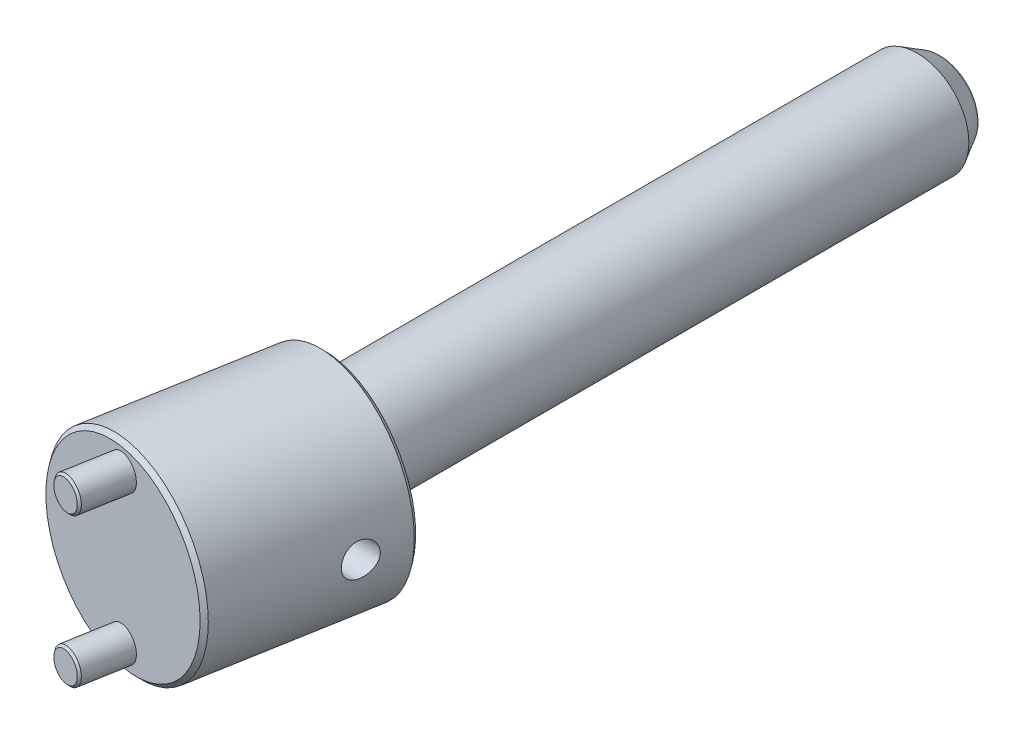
ISO-10303-21;
HEADER;
FILE_DESCRIPTION(('STEP AP214'),'2;1');
FILE_NAME('part.step','',(''),(''),'','','');
FILE_SCHEMA(('AUTOMOTIVE_DESIGN { 1 0 10303 214 1 1 1 1 }'));
ENDSEC;
DATA;
#1=APPLICATION_CONTEXT('core data for automotive mechanical design processes');
#2=APPLICATION_PROTOCOL_DEFINITION('international standard','automotive_design',2000,#1);
#3=PRODUCT_CONTEXT('',#1,'mechanical');
#4=PRODUCT('Part','Part','',(#3));
#5=PRODUCT_RELATED_PRODUCT_CATEGORY('part','',(#4));
#6=PRODUCT_DEFINITION_FORMATION('','',#4);
#7=PRODUCT_DEFINITION_CONTEXT('part definition',#1,'design');
#8=PRODUCT_DEFINITION('design','',#6,#7);
#9=PRODUCT_DEFINITION_SHAPE('','',#8);
#10=(LENGTH_UNIT() NAMED_UNIT(*) SI_UNIT(.MILLI.,.METRE.));
#11=(NAMED_UNIT(*) PLANE_ANGLE_UNIT() SI_UNIT($,.RADIAN.));
#12=(NAMED_UNIT(*) SI_UNIT($,.STERADIAN.) SOLID_ANGLE_UNIT());
#13=UNCERTAINTY_MEASURE_WITH_UNIT(LENGTH_MEASURE(1.E-05),#10,'distance_accuracy_value','');
#14=(GEOMETRIC_REPRESENTATION_CONTEXT(3) GLOBAL_UNCERTAINTY_ASSIGNED_CONTEXT((#13)) GLOBAL_UNIT_ASSIGNED_CONTEXT((#10,
#11,#12)) REPRESENTATION_CONTEXT('',''));
#15=CARTESIAN_POINT('',(0.,0.,0.));
#16=DIRECTION('',(0.,0.,1.));
#17=DIRECTION('',(1.,0.,0.));
#18=AXIS2_PLACEMENT_3D('',#15,#16,#17);
#19=CARTESIAN_POINT('',(0.,0.,-150.));
#20=DIRECTION('',(0.,0.,-1.));
#21=DIRECTION('',(0.,1.,0.));
#22=AXIS2_PLACEMENT_3D('',#19,#20,#21);
#23=PLANE('',#22);
#24=CARTESIAN_POINT('',(0.,0.,-150.));
#25=DIRECTION('',(0.,0.,1.));
#26=DIRECTION('',(-1.,0.,0.));
#27=AXIS2_PLACEMENT_3D('',#24,#25,#26);
#28=CIRCLE('',#27,7.881197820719);
#29=CARTESIAN_POINT('',(-7.8811978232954,0.,-150.));
#30=VERTEX_POINT('',#29);
#31=CARTESIAN_POINT('',(7.8811978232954,0.,-150.));
#32=VERTEX_POINT('',#31);
#33=EDGE_CURVE('P0_E38',#30,#32,#28,.T.);
#34=ORIENTED_EDGE('',*,*,#33,.F.);
#35=CARTESIAN_POINT('',(0.,0.,-150.));
#36=DIRECTION('',(0.,0.,1.));
#37=DIRECTION('',(1.,0.,0.));
#38=AXIS2_PLACEMENT_3D('',#35,#36,#37);
#39=CIRCLE('',#38,7.881197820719);
#40=EDGE_CURVE('P0_E42',#32,#30,#39,.T.);
#41=ORIENTED_EDGE('',*,*,#40,.F.);
#42=EDGE_LOOP('',(#34,#41));
#43=FACE_BOUND('',#42,.T.);
#44=ADVANCED_FACE('P0_F17',(#43),#23,.T.);
#45=CARTESIAN_POINT('',(0.,0.,-148.));
#46=DIRECTION('',(0.,0.,-1.));
#47=DIRECTION('',(0.999976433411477,-0.00686532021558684,0.));
#48=AXIS2_PLACEMENT_3D('',#45,#46,#47);
#49=TOROIDAL_SURFACE('',#48,7.881197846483,2.);
#50=ORIENTED_EDGE('',*,*,#33,.T.);
#51=ORIENTED_EDGE('',*,*,#40,.T.);
#52=EDGE_LOOP('',(#50,#51));
#53=FACE_BOUND('',#52,.T.);
#54=CARTESIAN_POINT('',(0.,0.,-149.000000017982));
#55=DIRECTION('',(0.,0.,1.));
#56=DIRECTION('',(1.,0.,0.));
#57=AXIS2_PLACEMENT_3D('',#54,#55,#56);
#58=CIRCLE('',#57,9.61324864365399);
#59=CARTESIAN_POINT('',(9.61324864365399,0.,-149.000000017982));
#60=VERTEX_POINT('',#59);
#61=EDGE_CURVE('P0_E48',#60,#60,#58,.T.);
#62=ORIENTED_EDGE('',*,*,#61,.F.);
#63=EDGE_LOOP('',(#62));
#64=FACE_BOUND('',#63,.T.);
#65=ADVANCED_FACE('P0_F40',(#53,#64),#49,.T.);
#66=CARTESIAN_POINT('',(0.,0.,37.5));
#67=DIRECTION('',(0.,0.,-1.));
#68=DIRECTION('',(0.,1.,0.));
#69=AXIS2_PLACEMENT_3D('',#66,#67,#68);
#70=PLANE('',#69);
#71=CARTESIAN_POINT('',(0.,0.,37.4999998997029));
#72=DIRECTION('',(0.,0.,-1.));
#73=DIRECTION('',(0.,1.,0.));
#74=AXIS2_PLACEMENT_3D('',#71,#72,#73);
#75=CIRCLE('',#74,11.4999995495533);
#76=CARTESIAN_POINT('',(0.,11.4999995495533,37.4999998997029));
#77=VERTEX_POINT('',#76);
#78=EDGE_CURVE('P0_E85',#77,#77,#75,.T.);
#79=ORIENTED_EDGE('',*,*,#78,.F.);
#80=EDGE_LOOP('',(#79));
#81=FACE_BOUND('',#80,.T.);
#82=ADVANCED_FACE('P0_F76',(#81),#70,.F.);
#83=CARTESIAN_POINT('',(4.30940107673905,0.,17.));
#84=DIRECTION('',(1.,0.,0.));
#85=DIRECTION('',(0.,0.,1.));
#86=AXIS2_PLACEMENT_3D('',#83,#84,#85);
#87=CONICAL_SURFACE('',#86,3.9999999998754,1.04719755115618);
#88=CARTESIAN_POINT('',(1.99999999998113,0.,16.9999999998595));
#89=VERTEX_POINT('',#88);
#90=VERTEX_LOOP('',#89);
#91=FACE_BOUND('',#90,.T.);
#92=CARTESIAN_POINT('',(4.309401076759,0.,17.));
#93=DIRECTION('',(1.,0.,0.));
#94=DIRECTION('',(0.,0.,1.));
#95=AXIS2_PLACEMENT_3D('',#92,#93,#94);
#96=CIRCLE('',#95,4.);
#97=CARTESIAN_POINT('',(4.309401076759,0.,21.));
#98=VERTEX_POINT('',#97);
#99=EDGE_CURVE('P0_E82',#98,#98,#96,.T.);
#100=ORIENTED_EDGE('',*,*,#99,.T.);
#101=EDGE_LOOP('',(#100));
#102=FACE_BOUND('',#101,.T.);
#103=ADVANCED_FACE('P0_F116',(#91,#102),#87,.F.);
#104=CARTESIAN_POINT('',(0.,0.,-143.999999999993));
#105=DIRECTION('',(0.,0.,1.));
#106=DIRECTION('',(0.,-1.,0.));
#107=AXIS2_PLACEMENT_3D('',#104,#105,#106);
#108=CONICAL_SURFACE('',#107,12.4999999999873,0.5235987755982);
#109=CARTESIAN_POINT('',(0.,0.,-144.));
#110=DIRECTION('',(0.,0.,-1.));
#111=DIRECTION('',(0.,1.,0.));
#112=AXIS2_PLACEMENT_3D('',#109,#110,#111);
#113=CIRCLE('',#112,12.5);
#114=CARTESIAN_POINT('',(0.,12.5,-144.));
#115=VERTEX_POINT('',#114);
#116=EDGE_CURVE('P0_E92',#115,#115,#113,.F.);
#117=ORIENTED_EDGE('',*,*,#116,.F.);
#118=EDGE_LOOP('',(#117));
#119=FACE_BOUND('',#118,.T.);
#120=ORIENTED_EDGE('',*,*,#61,.T.);
#121=EDGE_LOOP('',(#120));
#122=FACE_BOUND('',#121,.T.);
#123=ADVANCED_FACE('P0_F108',(#119,#122),#108,.T.);
#124=CARTESIAN_POINT('',(0.,0.,36.4999995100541));
#125=DIRECTION('',(0.,0.,-1.));
#126=DIRECTION('',(0.,1.,0.));
#127=AXIS2_PLACEMENT_3D('',#124,#125,#126);
#128=CONICAL_SURFACE('',#127,12.4999998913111,0.785398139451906);
#129=CARTESIAN_POINT('',(0.,0.,36.499999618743));
#130=DIRECTION('',(0.,0.,-1.));
#131=DIRECTION('',(0.,1.,0.));
#132=AXIS2_PLACEMENT_3D('',#129,#130,#131);
#133=CIRCLE('',#132,12.5);
#134=CARTESIAN_POINT('',(0.,12.5,36.499999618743));
#135=VERTEX_POINT('',#134);
#136=EDGE_CURVE('P0_E28',#135,#135,#133,.T.);
#137=ORIENTED_EDGE('',*,*,#136,.F.);
#138=EDGE_LOOP('',(#137));
#139=FACE_BOUND('',#138,.T.);
#140=ORIENTED_EDGE('',*,*,#78,.T.);
#141=EDGE_LOOP('',(#140));
#142=FACE_BOUND('',#141,.T.);
#143=ADVANCED_FACE('P0_F105',(#139,#142),#128,.T.);
#144=CARTESIAN_POINT('',(1.375,0.,17.));
#145=DIRECTION('',(1.,0.,0.));
#146=DIRECTION('',(0.,0.,1.));
#147=AXIS2_PLACEMENT_3D('',#144,#145,#146);
#148=CYLINDRICAL_SURFACE('',#147,4.);
#149=ORIENTED_EDGE('',*,*,#99,.F.);
#150=EDGE_LOOP('',(#149));
#151=FACE_BOUND('',#150,.T.);
#152=CARTESIAN_POINT('',(12.5,0.,21.));
#153=CARTESIAN_POINT('',(12.4999998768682,0.109267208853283,20.9999998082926));
#154=CARTESIAN_POINT('',(12.4985638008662,0.218537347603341,20.9955187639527));
#155=CARTESIAN_POINT('',(12.4928582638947,0.436308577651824,20.9776347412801));
#156=CARTESIAN_POINT('',(12.4885877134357,0.544809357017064,20.9642283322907));
#157=CARTESIAN_POINT('',(12.4773197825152,0.760358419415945,20.9285872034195));
#158=CARTESIAN_POINT('',(12.4703188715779,0.867404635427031,20.9063410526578));
#159=CARTESIAN_POINT('',(12.4537844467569,1.07914970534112,20.853228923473));
#160=CARTESIAN_POINT('',(12.4442499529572,1.18384763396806,20.8223596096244));
#161=CARTESIAN_POINT('',(12.412260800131,1.49277788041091,20.7173557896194));
#162=CARTESIAN_POINT('',(12.3863805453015,1.69256281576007,20.6307055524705));
#163=CARTESIAN_POINT('',(12.3281610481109,2.07458913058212,20.4268128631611));
#164=CARTESIAN_POINT('',(12.295822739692,2.25683304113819,20.3095748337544));
#165=CARTESIAN_POINT('',(12.2269279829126,2.60472253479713,20.043795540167));
#166=CARTESIAN_POINT('',(12.1902760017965,2.76972880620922,19.8944408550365));
#167=CARTESIAN_POINT('',(12.1174284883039,3.07283077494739,19.5704010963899));
#168=CARTESIAN_POINT('',(12.0812330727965,3.21091970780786,19.3957096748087));
#169=CARTESIAN_POINT('',(12.01237020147,3.45978450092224,19.0203675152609));
#170=CARTESIAN_POINT('',(11.9798194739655,3.56975347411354,18.8191582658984));
#171=CARTESIAN_POINT('',(11.9233663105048,3.75402351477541,18.399892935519));
#172=CARTESIAN_POINT('',(11.8994614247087,3.82833468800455,18.1818416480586));
#173=CARTESIAN_POINT('',(11.8640030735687,3.93682830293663,17.7422935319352));
#174=CARTESIAN_POINT('',(11.8520853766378,3.97219740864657,17.5211198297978));
#175=CARTESIAN_POINT('',(11.8408707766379,4.00551082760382,17.0756810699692));
#176=CARTESIAN_POINT('',(11.8415703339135,4.00346563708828,16.8514168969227));
#177=CARTESIAN_POINT('',(11.8551904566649,3.96293460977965,16.4160865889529));
#178=CARTESIAN_POINT('',(11.8676003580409,3.92597140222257,16.2048599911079));
#179=CARTESIAN_POINT('',(11.9024113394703,3.81912665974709,15.791778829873));
#180=CARTESIAN_POINT('',(11.9248135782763,3.74924130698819,15.5899253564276));
#181=CARTESIAN_POINT('',(11.9774670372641,3.5774893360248,15.1977500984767));
#182=CARTESIAN_POINT('',(12.0078322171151,3.47515345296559,15.0076498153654));
#183=CARTESIAN_POINT('',(12.0729382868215,3.2417276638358,14.6468343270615));
#184=CARTESIAN_POINT('',(12.107680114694,3.11063158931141,14.4761232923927));
#185=CARTESIAN_POINT('',(12.1796519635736,2.81604951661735,14.1503715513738));
#186=CARTESIAN_POINT('',(12.2169216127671,2.65131653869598,13.9964671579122));
#187=CARTESIAN_POINT('',(12.2883204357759,2.29773509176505,13.7180823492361));
#188=CARTESIAN_POINT('',(12.3224482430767,2.10887621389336,13.5936147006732));
#189=CARTESIAN_POINT('',(12.368603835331,1.8105187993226,13.4313785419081));
#190=CARTESIAN_POINT('',(12.3832112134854,1.70799133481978,13.3811846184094));
#191=CARTESIAN_POINT('',(12.4102662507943,1.49879447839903,13.2896595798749));
#192=CARTESIAN_POINT('',(12.4227147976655,1.39212681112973,13.2483248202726));
#193=CARTESIAN_POINT('',(12.4450730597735,1.17558171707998,13.1749428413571));
#194=CARTESIAN_POINT('',(12.4549867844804,1.0657096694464,13.1428809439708));
#195=CARTESIAN_POINT('',(12.4720081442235,0.843458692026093,13.0882661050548));
#196=CARTESIAN_POINT('',(12.4791170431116,0.731080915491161,13.0657088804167));
#197=CARTESIAN_POINT('',(12.4897717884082,0.515800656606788,13.0320501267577));
#198=CARTESIAN_POINT('',(12.4935992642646,0.413053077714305,13.0200402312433));
#199=CARTESIAN_POINT('',(12.498713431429,0.206871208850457,13.0040150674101));
#200=CARTESIAN_POINT('',(12.5000001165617,0.103436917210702,12.9999998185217));
#201=CARTESIAN_POINT('',(12.4999998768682,-0.109267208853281,13.0000001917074));
#202=CARTESIAN_POINT('',(12.4985638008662,-0.218537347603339,13.0044812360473));
#203=CARTESIAN_POINT('',(12.4928582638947,-0.436308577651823,13.0223652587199));
#204=CARTESIAN_POINT('',(12.4885877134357,-0.544809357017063,13.0357716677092));
#205=CARTESIAN_POINT('',(12.4773197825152,-0.760358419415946,13.0714127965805));
#206=CARTESIAN_POINT('',(12.4703188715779,-0.867404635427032,13.0936589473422));
#207=CARTESIAN_POINT('',(12.4537844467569,-1.07914970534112,13.146771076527));
#208=CARTESIAN_POINT('',(12.4442499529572,-1.18384763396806,13.1776403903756));
#209=CARTESIAN_POINT('',(12.412260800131,-1.4927778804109,13.2826442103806));
#210=CARTESIAN_POINT('',(12.3863805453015,-1.69256281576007,13.3692944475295));
#211=CARTESIAN_POINT('',(12.3281610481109,-2.07458913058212,13.5731871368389));
#212=CARTESIAN_POINT('',(12.295822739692,-2.25683304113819,13.6904251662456));
#213=CARTESIAN_POINT('',(12.2269279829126,-2.60472253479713,13.956204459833));
#214=CARTESIAN_POINT('',(12.1902760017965,-2.76972880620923,14.1055591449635));
#215=CARTESIAN_POINT('',(12.1174284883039,-3.0728307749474,14.4295989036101));
#216=CARTESIAN_POINT('',(12.0812330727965,-3.21091970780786,14.6042903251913));
#217=CARTESIAN_POINT('',(12.01237020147,-3.45978450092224,14.9796324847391));
#218=CARTESIAN_POINT('',(11.9798194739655,-3.56975347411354,15.1808417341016));
#219=CARTESIAN_POINT('',(11.9233663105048,-3.75402351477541,15.600107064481));
#220=CARTESIAN_POINT('',(11.8994614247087,-3.82833468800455,15.8181583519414));
#221=CARTESIAN_POINT('',(11.8640030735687,-3.93682830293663,16.2577064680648));
#222=CARTESIAN_POINT('',(11.8520853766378,-3.97219740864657,16.4788801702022));
#223=CARTESIAN_POINT('',(11.8408707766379,-4.00551082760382,16.9243189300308));
#224=CARTESIAN_POINT('',(11.8415703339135,-4.00346563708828,17.1485831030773));
#225=CARTESIAN_POINT('',(11.8551904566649,-3.96293460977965,17.583913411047));
#226=CARTESIAN_POINT('',(11.8676003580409,-3.92597140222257,17.7951400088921));
#227=CARTESIAN_POINT('',(11.9024113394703,-3.81912665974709,18.208221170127));
#228=CARTESIAN_POINT('',(11.9248135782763,-3.74924130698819,18.4100746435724));
#229=CARTESIAN_POINT('',(11.9774670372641,-3.5774893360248,18.8022499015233));
#230=CARTESIAN_POINT('',(12.0078322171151,-3.47515345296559,18.9923501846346));
#231=CARTESIAN_POINT('',(12.0729382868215,-3.2417276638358,19.3531656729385));
#232=CARTESIAN_POINT('',(12.107680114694,-3.11063158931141,19.5238767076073));
#233=CARTESIAN_POINT('',(12.1796519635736,-2.81604951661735,19.8496284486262));
#234=CARTESIAN_POINT('',(12.2169216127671,-2.65131653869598,20.0035328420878));
#235=CARTESIAN_POINT('',(12.2883204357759,-2.29773509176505,20.2819176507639));
#236=CARTESIAN_POINT('',(12.3224482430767,-2.10887621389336,20.4063852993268));
#237=CARTESIAN_POINT('',(12.368603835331,-1.8105187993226,20.5686214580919));
#238=CARTESIAN_POINT('',(12.3832112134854,-1.70799133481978,20.6188153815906));
#239=CARTESIAN_POINT('',(12.4102662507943,-1.49879447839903,20.7103404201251));
#240=CARTESIAN_POINT('',(12.4227147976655,-1.39212681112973,20.7516751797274));
#241=CARTESIAN_POINT('',(12.4450730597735,-1.17558171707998,20.8250571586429));
#242=CARTESIAN_POINT('',(12.4549867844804,-1.0657096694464,20.8571190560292));
#243=CARTESIAN_POINT('',(12.4720081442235,-0.843458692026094,20.9117338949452));
#244=CARTESIAN_POINT('',(12.4791170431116,-0.731080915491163,20.9342911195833));
#245=CARTESIAN_POINT('',(12.4897717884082,-0.515800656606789,20.9679498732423));
#246=CARTESIAN_POINT('',(12.4935992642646,-0.413053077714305,20.9799597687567));
#247=CARTESIAN_POINT('',(12.498713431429,-0.206871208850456,20.9959849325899));
#248=CARTESIAN_POINT('',(12.5000001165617,-0.103436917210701,21.0000001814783));
#249=CARTESIAN_POINT('',(12.5,0.,21.));
#250=B_SPLINE_CURVE_WITH_KNOTS('',3,(#152,#153,#154,#155,#156,#157,#158,#159,#160,#161,#162,
#163,#164,#165,#166,#167,#168,#169,#170,#171,#172,#173,#174,#175,#176,#177,#178,#179,#180,#181,
#182,#183,#184,#185,#186,#187,#188,#189,#190,#191,#192,#193,#194,#195,#196,#197,#198,#199,#200,
#201,#202,#203,#204,#205,#206,#207,#208,#209,#210,#211,#212,#213,#214,#215,#216,#217,#218,#219,
#220,#221,#222,#223,#224,#225,#226,#227,#228,#229,#230,#231,#232,#233,#234,#235,#236,#237,#238,
#239,#240,#241,#242,#243,#244,#245,#246,#247,#248,#249),.UNSPECIFIED.,.T.,.F.,(4,2,2,2,2,2,2,2,
2,2,2,2,2,2,2,2,2,2,2,2,2,2,2,2,2,2,2,2,2,2,2,2,2,2,2,2,2,2,2,2,2,2,2,2,2,2,2,2,4),(0.,
0.327705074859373,0.655536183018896,0.983792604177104,1.31217617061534,1.96678919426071,
2.62130761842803,3.29492000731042,3.96870146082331,4.66006760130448,5.35123768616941,
6.0207071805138,6.68998886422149,7.33137068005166,7.97282689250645,8.62401811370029,
9.27534913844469,9.95775723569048,10.6404607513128,10.9853574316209,11.3301119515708,
11.6743177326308,12.0183682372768,12.3285868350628,12.6388061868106,12.9665112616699,
13.2943423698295,13.6225987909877,13.9509823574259,14.6055953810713,15.2601138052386,
15.933726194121,16.6075076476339,17.298873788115,17.99004387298,18.6595133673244,
19.3287950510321,19.9701768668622,20.611633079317,21.2628243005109,21.9141553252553,
22.596563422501,23.2792669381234,23.6241636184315,23.9689181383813,24.3131239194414,
24.6571744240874,24.9673930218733,25.2776123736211),.UNSPECIFIED.);
#251=CARTESIAN_POINT('',(12.5,0.,21.));
#252=VERTEX_POINT('',#251);
#253=EDGE_CURVE('P0_E11',#252,#252,#250,.T.);
#254=ORIENTED_EDGE('',*,*,#253,.F.);
#255=EDGE_LOOP('',(#254));
#256=FACE_BOUND('',#255,.T.);
#257=ADVANCED_FACE('P0_F107',(#151,#256),#148,.F.);
#258=CARTESIAN_POINT('',(0.,0.,46.875));
#259=DIRECTION('',(0.,0.,-1.));
#260=DIRECTION('',(0.,1.,0.));
#261=AXIS2_PLACEMENT_3D('',#258,#259,#260);
#262=CYLINDRICAL_SURFACE('',#261,12.5);
#263=ORIENTED_EDGE('',*,*,#116,.T.);
#264=EDGE_LOOP('',(#263));
#265=FACE_BOUND('',#264,.T.);
#266=ORIENTED_EDGE('',*,*,#136,.T.);
#267=EDGE_LOOP('',(#266));
#268=FACE_BOUND('',#267,.T.);
#269=ORIENTED_EDGE('',*,*,#253,.T.);
#270=EDGE_LOOP('',(#269));
#271=FACE_BOUND('',#270,.T.);
#272=ADVANCED_FACE('P0_F102',(#265,#268,#271),#262,.T.);
#273=CLOSED_SHELL('',(#44,#65,#82,#103,#123,#143,#257,#272));
#274=MANIFOLD_SOLID_BREP('P0_B1',#273);
#275=CARTESIAN_POINT('',(-4.97390736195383,0.,57.0022828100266));
#276=DIRECTION('',(-0.173648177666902,0.,0.984807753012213));
#277=DIRECTION('',(-0.984807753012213,0.,-0.173648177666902));
#278=AXIS2_PLACEMENT_3D('',#275,#276,#277);
#279=PLANE('',#278);
#280=CARTESIAN_POINT('',(-4.97390736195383,18.,57.0022828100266));
#281=DIRECTION('',(-0.173648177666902,0.,0.984807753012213));
#282=DIRECTION('',(-0.984807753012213,0.,-0.173648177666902));
#283=AXIS2_PLACEMENT_3D('',#280,#281,#282);
#284=CIRCLE('',#283,3.50000030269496);
#285=CARTESIAN_POINT('',(-8.42073479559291,18.,56.39451413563));
#286=VERTEX_POINT('',#285);
#287=EDGE_CURVE('P1_E17',#286,#286,#284,.F.);
#288=ORIENTED_EDGE('',*,*,#287,.F.);
#289=EDGE_LOOP('',(#288));
#290=FACE_BOUND('',#289,.T.);
#291=ADVANCED_FACE('P1_F14',(#290),#279,.T.);
#292=CARTESIAN_POINT('',(-4.97390736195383,0.,57.0022828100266));
#293=DIRECTION('',(-0.173648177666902,0.,0.984807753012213));
#294=DIRECTION('',(-0.984807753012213,0.,-0.173648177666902));
#295=AXIS2_PLACEMENT_3D('',#292,#293,#294);
#296=PLANE('',#295);
#297=CARTESIAN_POINT('',(-4.97390736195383,-18.,57.0022828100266));
#298=DIRECTION('',(-0.173648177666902,0.,0.984807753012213));
#299=DIRECTION('',(-0.984807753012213,0.,-0.173648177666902));
#300=AXIS2_PLACEMENT_3D('',#297,#298,#299);
#301=CIRCLE('',#300,3.50000030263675);
#302=CARTESIAN_POINT('',(-8.42073479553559,-18.,56.3945141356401));
#303=VERTEX_POINT('',#302);
#304=EDGE_CURVE('P1_E121',#303,#303,#301,.F.);
#305=ORIENTED_EDGE('',*,*,#304,.F.);
#306=EDGE_LOOP('',(#305));
#307=FACE_BOUND('',#306,.T.);
#308=ADVANCED_FACE('P1_F111',(#307),#296,.T.);
#309=CARTESIAN_POINT('',(-3.17454396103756E-13,0.,37.4999999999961));
#310=DIRECTION('',(0.,0.,1.));
#311=DIRECTION('',(-1.,0.,0.));
#312=AXIS2_PLACEMENT_3D('',#309,#310,#311);
#313=PLANE('',#312);
#314=CARTESIAN_POINT('',(-1.48579065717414E-12,0.,37.4999999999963));
#315=DIRECTION('',(0.,0.,1.));
#316=DIRECTION('',(-1.,0.,0.));
#317=AXIS2_PLACEMENT_3D('',#314,#315,#316);
#318=CIRCLE('',#317,12.5);
#319=CARTESIAN_POINT('',(-12.5000000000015,0.,37.4999999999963));
#320=VERTEX_POINT('',#319);
#321=EDGE_CURVE('P1_E36',#320,#320,#318,.F.);
#322=ORIENTED_EDGE('',*,*,#321,.T.);
#323=EDGE_LOOP('',(#322));
#324=FACE_BOUND('',#323,.T.);
#325=ADVANCED_FACE('P1_F108',(#324),#313,.F.);
#326=CARTESIAN_POINT('',(-4.88708307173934,18.,56.5098777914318));
#327=DIRECTION('',(0.173648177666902,0.,-0.984807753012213));
#328=DIRECTION('',(0.984807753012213,0.,0.173648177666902));
#329=AXIS2_PLACEMENT_3D('',#326,#327,#328);
#330=CONICAL_SURFACE('',#329,4.00000150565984,0.785398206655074);
#331=CARTESIAN_POINT('',(-4.88708281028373,18.,56.5098763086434));
#332=DIRECTION('',(-0.173648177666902,0.,0.984807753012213));
#333=DIRECTION('',(-0.984807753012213,0.,-0.173648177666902));
#334=AXIS2_PLACEMENT_3D('',#331,#332,#333);
#335=CIRCLE('',#334,4.);
#336=CARTESIAN_POINT('',(-8.82631382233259,18.,55.8152835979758));
#337=VERTEX_POINT('',#336);
#338=EDGE_CURVE('P1_E33',#337,#337,#335,.F.);
#339=ORIENTED_EDGE('',*,*,#338,.F.);
#340=EDGE_LOOP('',(#339));
#341=FACE_BOUND('',#340,.T.);
#342=ORIENTED_EDGE('',*,*,#287,.T.);
#343=EDGE_LOOP('',(#342));
#344=FACE_BOUND('',#343,.T.);
#345=ADVANCED_FACE('P1_F104',(#341,#344),#330,.T.);
#346=CARTESIAN_POINT('',(-4.88708307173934,-18.,56.5098777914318));
#347=DIRECTION('',(0.173648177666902,0.,-0.984807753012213));
#348=DIRECTION('',(0.984807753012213,0.,0.173648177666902));
#349=AXIS2_PLACEMENT_3D('',#346,#347,#348);
#350=CONICAL_SURFACE('',#349,4.00000150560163,0.785398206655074);
#351=CARTESIAN_POINT('',(-4.88708281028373,-18.,56.5098763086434));
#352=DIRECTION('',(-0.173648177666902,0.,0.984807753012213));
#353=DIRECTION('',(-0.984807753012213,0.,-0.173648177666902));
#354=AXIS2_PLACEMENT_3D('',#351,#352,#353);
#355=CIRCLE('',#354,4.);
#356=CARTESIAN_POINT('',(-8.82631382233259,-18.,55.8152835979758));
#357=VERTEX_POINT('',#356);
#358=EDGE_CURVE('P1_E29',#357,#357,#355,.F.);
#359=ORIENTED_EDGE('',*,*,#358,.F.);
#360=EDGE_LOOP('',(#359));
#361=FACE_BOUND('',#360,.T.);
#362=ORIENTED_EDGE('',*,*,#304,.T.);
#363=EDGE_LOOP('',(#362));
#364=FACE_BOUND('',#363,.T.);
#365=ADVANCED_FACE('P1_F99',(#361,#364),#350,.T.);
#366=CARTESIAN_POINT('',(-1.48752538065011E-12,0.,-14.7263884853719));
#367=DIRECTION('',(0.,0.,1.));
#368=DIRECTION('',(-1.,0.,0.));
#369=AXIS2_PLACEMENT_3D('',#366,#367,#368);
#370=CYLINDRICAL_SURFACE('',#369,12.5);
#371=CARTESIAN_POINT('',(-1.48665801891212E-12,0.,-4.10088629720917E-12));
#372=DIRECTION('',(0.173648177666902,0.,-0.984807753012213));
#373=DIRECTION('',(0.984807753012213,0.,0.173648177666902));
#374=AXIS2_PLACEMENT_3D('',#371,#372,#373);
#375=ELLIPSE('',#374,12.6928326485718,12.5);
#376=CARTESIAN_POINT('',(12.4999999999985,0.,2.20408725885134));
#377=VERTEX_POINT('',#376);
#378=EDGE_CURVE('P1_E32',#377,#377,#375,.F.);
#379=ORIENTED_EDGE('',*,*,#378,.F.);
#380=EDGE_LOOP('',(#379));
#381=FACE_BOUND('',#380,.T.);
#382=ORIENTED_EDGE('',*,*,#321,.F.);
#383=EDGE_LOOP('',(#382));
#384=FACE_BOUND('',#383,.T.);
#385=CARTESIAN_POINT('',(12.4999999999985,0.,12.9999999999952));
#386=CARTESIAN_POINT('',(12.4999998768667,0.109267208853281,13.0000001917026));
#387=CARTESIAN_POINT('',(12.4985638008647,0.218537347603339,13.0044812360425));
#388=CARTESIAN_POINT('',(12.4928582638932,0.436308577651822,13.0223652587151));
#389=CARTESIAN_POINT('',(12.4885877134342,0.544809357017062,13.0357716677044));
#390=CARTESIAN_POINT('',(12.4773197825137,0.760358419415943,13.0714127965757));
#391=CARTESIAN_POINT('',(12.4703188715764,0.867404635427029,13.0936589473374));
#392=CARTESIAN_POINT('',(12.4537844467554,1.07914970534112,13.1467710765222));
#393=CARTESIAN_POINT('',(12.4442499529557,1.18384763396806,13.1776403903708));
#394=CARTESIAN_POINT('',(12.4122608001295,1.4927778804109,13.2826442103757));
#395=CARTESIAN_POINT('',(12.3863805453,1.69256281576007,13.3692944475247));
#396=CARTESIAN_POINT('',(12.3281610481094,2.07458913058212,13.5731871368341));
#397=CARTESIAN_POINT('',(12.2958227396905,2.25683304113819,13.6904251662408));
#398=CARTESIAN_POINT('',(12.2269279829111,2.60472253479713,13.9562044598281));
#399=CARTESIAN_POINT('',(12.190276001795,2.76972880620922,14.1055591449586));
#400=CARTESIAN_POINT('',(12.1174284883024,3.07283077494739,14.4295989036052));
#401=CARTESIAN_POINT('',(12.081233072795,3.21091970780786,14.6042903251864));
#402=CARTESIAN_POINT('',(12.0123702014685,3.45978450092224,14.9796324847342));
#403=CARTESIAN_POINT('',(11.979819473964,3.56975347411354,15.1808417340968));
#404=CARTESIAN_POINT('',(11.9233663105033,3.75402351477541,15.6001070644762));
#405=CARTESIAN_POINT('',(11.8994614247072,3.82833468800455,15.8181583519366));
#406=CARTESIAN_POINT('',(11.8640030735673,3.93682830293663,16.2577064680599));
#407=CARTESIAN_POINT('',(11.8520853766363,3.97219740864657,16.4788801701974));
#408=CARTESIAN_POINT('',(11.8408707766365,4.00551082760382,16.924318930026));
#409=CARTESIAN_POINT('',(11.841570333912,4.00346563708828,17.1485831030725));
#410=CARTESIAN_POINT('',(11.8551904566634,3.96293460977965,17.5839134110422));
#411=CARTESIAN_POINT('',(11.8676003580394,3.92597140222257,17.7951400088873));
#412=CARTESIAN_POINT('',(11.9024113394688,3.81912665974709,18.2082211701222));
#413=CARTESIAN_POINT('',(11.9248135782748,3.74924130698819,18.4100746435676));
#414=CARTESIAN_POINT('',(11.9774670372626,3.5774893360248,18.8022499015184));
#415=CARTESIAN_POINT('',(12.0078322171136,3.47515345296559,18.9923501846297));
#416=CARTESIAN_POINT('',(12.07293828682,3.2417276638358,19.3531656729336));
#417=CARTESIAN_POINT('',(12.1076801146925,3.11063158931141,19.5238767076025));
#418=CARTESIAN_POINT('',(12.1796519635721,2.81604951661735,19.8496284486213));
#419=CARTESIAN_POINT('',(12.2169216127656,2.65131653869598,20.0035328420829));
#420=CARTESIAN_POINT('',(12.2883204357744,2.29773509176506,20.2819176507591));
#421=CARTESIAN_POINT('',(12.3224482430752,2.10887621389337,20.406385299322));
#422=CARTESIAN_POINT('',(12.3686038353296,1.81051879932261,20.568621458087));
#423=CARTESIAN_POINT('',(12.3832112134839,1.70799133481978,20.6188153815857));
#424=CARTESIAN_POINT('',(12.4102662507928,1.49879447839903,20.7103404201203));
#425=CARTESIAN_POINT('',(12.422714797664,1.39212681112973,20.7516751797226));
#426=CARTESIAN_POINT('',(12.445073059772,1.17558171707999,20.825057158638));
#427=CARTESIAN_POINT('',(12.4549867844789,1.06570966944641,20.8571190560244));
#428=CARTESIAN_POINT('',(12.472008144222,0.843458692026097,20.9117338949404));
#429=CARTESIAN_POINT('',(12.4791170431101,0.731080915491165,20.9342911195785));
#430=CARTESIAN_POINT('',(12.4897717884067,0.515800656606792,20.9679498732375));
#431=CARTESIAN_POINT('',(12.4935992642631,0.413053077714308,20.9799597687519));
#432=CARTESIAN_POINT('',(12.4987134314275,0.206871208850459,20.995984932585));
#433=CARTESIAN_POINT('',(12.5000001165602,0.103436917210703,21.0000001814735));
#434=CARTESIAN_POINT('',(12.4999998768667,-0.109267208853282,20.9999998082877));
#435=CARTESIAN_POINT('',(12.4985638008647,-0.21853734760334,20.9955187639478));
#436=CARTESIAN_POINT('',(12.4928582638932,-0.436308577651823,20.9776347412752));
#437=CARTESIAN_POINT('',(12.4885877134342,-0.544809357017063,20.9642283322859));
#438=CARTESIAN_POINT('',(12.4773197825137,-0.760358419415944,20.9285872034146));
#439=CARTESIAN_POINT('',(12.4703188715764,-0.86740463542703,20.9063410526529));
#440=CARTESIAN_POINT('',(12.4537844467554,-1.07914970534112,20.8532289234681));
#441=CARTESIAN_POINT('',(12.4442499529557,-1.18384763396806,20.8223596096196));
#442=CARTESIAN_POINT('',(12.4122608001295,-1.4927778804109,20.7173557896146));
#443=CARTESIAN_POINT('',(12.3863805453,-1.69256281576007,20.6307055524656));
#444=CARTESIAN_POINT('',(12.3281610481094,-2.07458913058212,20.4268128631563));
#445=CARTESIAN_POINT('',(12.2958227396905,-2.25683304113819,20.3095748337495));
#446=CARTESIAN_POINT('',(12.2269279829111,-2.60472253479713,20.0437955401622));
#447=CARTESIAN_POINT('',(12.190276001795,-2.76972880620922,19.8944408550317));
#448=CARTESIAN_POINT('',(12.1174284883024,-3.07283077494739,19.5704010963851));
#449=CARTESIAN_POINT('',(12.081233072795,-3.21091970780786,19.3957096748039));
#450=CARTESIAN_POINT('',(12.0123702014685,-3.45978450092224,19.0203675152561));
#451=CARTESIAN_POINT('',(11.979819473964,-3.56975347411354,18.8191582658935));
#452=CARTESIAN_POINT('',(11.9233663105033,-3.75402351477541,18.3998929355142));
#453=CARTESIAN_POINT('',(11.8994614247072,-3.82833468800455,18.1818416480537));
#454=CARTESIAN_POINT('',(11.8640030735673,-3.93682830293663,17.7422935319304));
#455=CARTESIAN_POINT('',(11.8520853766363,-3.97219740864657,17.521119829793));
#456=CARTESIAN_POINT('',(11.8408707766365,-4.00551082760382,17.0756810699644));
#457=CARTESIAN_POINT('',(11.841570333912,-4.00346563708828,16.8514168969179));
#458=CARTESIAN_POINT('',(11.8551904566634,-3.96293460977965,16.4160865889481));
#459=CARTESIAN_POINT('',(11.8676003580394,-3.92597140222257,16.2048599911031));
#460=CARTESIAN_POINT('',(11.9024113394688,-3.81912665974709,15.7917788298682));
#461=CARTESIAN_POINT('',(11.9248135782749,-3.74924130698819,15.5899253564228));
#462=CARTESIAN_POINT('',(11.9774670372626,-3.5774893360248,15.1977500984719));
#463=CARTESIAN_POINT('',(12.0078322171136,-3.47515345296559,15.0076498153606));
#464=CARTESIAN_POINT('',(12.07293828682,-3.2417276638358,14.6468343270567));
#465=CARTESIAN_POINT('',(12.1076801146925,-3.11063158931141,14.4761232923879));
#466=CARTESIAN_POINT('',(12.1796519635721,-2.81604951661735,14.150371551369));
#467=CARTESIAN_POINT('',(12.2169216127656,-2.65131653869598,13.9964671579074));
#468=CARTESIAN_POINT('',(12.2883204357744,-2.29773509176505,13.7180823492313));
#469=CARTESIAN_POINT('',(12.3224482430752,-2.10887621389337,13.5936147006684));
#470=CARTESIAN_POINT('',(12.3686038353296,-1.81051879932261,13.4313785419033));
#471=CARTESIAN_POINT('',(12.3832112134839,-1.70799133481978,13.3811846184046));
#472=CARTESIAN_POINT('',(12.4102662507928,-1.49879447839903,13.28965957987));
#473=CARTESIAN_POINT('',(12.422714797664,-1.39212681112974,13.2483248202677));
#474=CARTESIAN_POINT('',(12.445073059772,-1.17558171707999,13.1749428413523));
#475=CARTESIAN_POINT('',(12.4549867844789,-1.06570966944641,13.1428809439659));
#476=CARTESIAN_POINT('',(12.472008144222,-0.843458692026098,13.08826610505));
#477=CARTESIAN_POINT('',(12.4791170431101,-0.731080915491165,13.0657088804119));
#478=CARTESIAN_POINT('',(12.4897717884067,-0.51580065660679,13.0320501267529));
#479=CARTESIAN_POINT('',(12.4935992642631,-0.413053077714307,13.0200402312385));
#480=CARTESIAN_POINT('',(12.4987134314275,-0.206871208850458,13.0040150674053));
#481=CARTESIAN_POINT('',(12.5000001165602,-0.103436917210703,12.9999998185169));
#482=CARTESIAN_POINT('',(12.4999999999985,0.,12.9999999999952));
#483=B_SPLINE_CURVE_WITH_KNOTS('',3,(#385,#386,#387,#388,#389,#390,#391,#392,#393,#394,#395,
#396,#397,#398,#399,#400,#401,#402,#403,#404,#405,#406,#407,#408,#409,#410,#411,#412,#413,#414,
#415,#416,#417,#418,#419,#420,#421,#422,#423,#424,#425,#426,#427,#428,#429,#430,#431,#432,#433,
#434,#435,#436,#437,#438,#439,#440,#441,#442,#443,#444,#445,#446,#447,#448,#449,#450,#451,#452,
#453,#454,#455,#456,#457,#458,#459,#460,#461,#462,#463,#464,#465,#466,#467,#468,#469,#470,#471,
#472,#473,#474,#475,#476,#477,#478,#479,#480,#481,#482),.UNSPECIFIED.,.T.,.F.,(4,2,2,2,2,2,2,2,
2,2,2,2,2,2,2,2,2,2,2,2,2,2,2,2,2,2,2,2,2,2,2,2,2,2,2,2,2,2,2,2,2,2,2,2,2,2,2,2,4),(0.,
0.327705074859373,0.655536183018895,0.983792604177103,1.31217617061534,1.9667891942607,
2.62130761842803,3.29492000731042,3.96870146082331,4.66006760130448,5.35123768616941,
6.0207071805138,6.6899888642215,7.33137068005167,7.97282689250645,8.62401811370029,
9.27534913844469,9.95775723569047,10.6404607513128,10.9853574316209,11.3301119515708,
11.6743177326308,12.0183682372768,12.3285868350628,12.6388061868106,12.9665112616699,
13.2943423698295,13.6225987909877,13.9509823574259,14.6055953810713,15.2601138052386,
15.933726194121,16.6075076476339,17.298873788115,17.99004387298,18.6595133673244,
19.3287950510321,19.9701768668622,20.611633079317,21.2628243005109,21.9141553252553,
22.596563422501,23.2792669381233,23.6241636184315,23.9689181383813,24.3131239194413,
24.6571744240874,24.9673930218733,25.2776123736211),.UNSPECIFIED.);
#484=CARTESIAN_POINT('',(12.4999999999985,0.,12.9999999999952));
#485=VERTEX_POINT('',#484);
#486=EDGE_CURVE('P1_E84',#485,#485,#483,.T.);
#487=ORIENTED_EDGE('',*,*,#486,.T.);
#488=EDGE_LOOP('',(#487));
#489=FACE_BOUND('',#488,.T.);
#490=ADVANCED_FACE('P1_F93',(#381,#384,#489),#370,.F.);
#491=CARTESIAN_POINT('',(-2.890129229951,18.,45.18458977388));
#492=DIRECTION('',(-0.173648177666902,0.,0.984807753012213));
#493=DIRECTION('',(-0.984807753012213,0.,-0.173648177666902));
#494=AXIS2_PLACEMENT_3D('',#491,#492,#493);
#495=CYLINDRICAL_SURFACE('',#494,4.);
#496=CARTESIAN_POINT('',(-2.890129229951,18.,45.18458977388));
#497=DIRECTION('',(-0.173648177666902,0.,0.984807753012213));
#498=DIRECTION('',(-0.984807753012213,0.,-0.173648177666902));
#499=AXIS2_PLACEMENT_3D('',#496,#497,#498);
#500=CIRCLE('',#499,4.);
#501=CARTESIAN_POINT('',(-6.82936024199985,18.,44.4899970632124));
#502=VERTEX_POINT('',#501);
#503=EDGE_CURVE('P1_E80',#502,#502,#500,.T.);
#504=ORIENTED_EDGE('',*,*,#503,.T.);
#505=EDGE_LOOP('',(#504));
#506=FACE_BOUND('',#505,.T.);
#507=ORIENTED_EDGE('',*,*,#338,.T.);
#508=EDGE_LOOP('',(#507));
#509=FACE_BOUND('',#508,.T.);
#510=ADVANCED_FACE('P1_F98',(#506,#509),#495,.T.);
#511=CARTESIAN_POINT('',(-2.890129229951,-18.,45.18458977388));
#512=DIRECTION('',(-0.173648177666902,0.,0.984807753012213));
#513=DIRECTION('',(-0.984807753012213,0.,-0.173648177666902));
#514=AXIS2_PLACEMENT_3D('',#511,#512,#513);
#515=CYLINDRICAL_SURFACE('',#514,4.);
#516=CARTESIAN_POINT('',(-2.890129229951,-18.,45.18458977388));
#517=DIRECTION('',(-0.173648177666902,0.,0.984807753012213));
#518=DIRECTION('',(-0.984807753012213,0.,-0.173648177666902));
#519=AXIS2_PLACEMENT_3D('',#516,#517,#518);
#520=CIRCLE('',#519,4.);
#521=CARTESIAN_POINT('',(-6.82936024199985,-18.,44.4899970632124));
#522=VERTEX_POINT('',#521);
#523=EDGE_CURVE('P1_E76',#522,#522,#520,.T.);
#524=ORIENTED_EDGE('',*,*,#523,.T.);
#525=EDGE_LOOP('',(#524));
#526=FACE_BOUND('',#525,.T.);
#527=ORIENTED_EDGE('',*,*,#358,.T.);
#528=EDGE_LOOP('',(#527));
#529=FACE_BOUND('',#528,.T.);
#530=ADVANCED_FACE('P1_F178',(#526,#529),#515,.T.);
#531=CARTESIAN_POINT('',(4.9240387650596,0.,0.868240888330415));
#532=DIRECTION('',(0.173648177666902,0.,-0.984807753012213));
#533=DIRECTION('',(0.984807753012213,0.,0.173648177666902));
#534=AXIS2_PLACEMENT_3D('',#531,#532,#533);
#535=PLANE('',#534);
#536=ORIENTED_EDGE('',*,*,#378,.T.);
#537=EDGE_LOOP('',(#536));
#538=FACE_BOUND('',#537,.T.);
#539=CARTESIAN_POINT('',(4.9240387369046,0.,0.868241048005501));
#540=DIRECTION('',(-0.173648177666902,0.,0.984807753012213));
#541=DIRECTION('',(-0.984807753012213,0.,-0.173648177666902));
#542=AXIS2_PLACEMENT_3D('',#539,#540,#541);
#543=CIRCLE('',#542,22.9999993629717);
#544=CARTESIAN_POINT('',(-17.7265389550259,0.,-3.12566692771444));
#545=VERTEX_POINT('',#544);
#546=EDGE_CURVE('P1_E46',#545,#545,#543,.T.);
#547=ORIENTED_EDGE('',*,*,#546,.F.);
#548=EDGE_LOOP('',(#547));
#549=FACE_BOUND('',#548,.T.);
#550=ADVANCED_FACE('P1_F71',(#538,#549),#535,.T.);
#551=CARTESIAN_POINT('',(-5.13758096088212,0.,16.9999999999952));
#552=DIRECTION('',(1.,0.,0.));
#553=DIRECTION('',(0.,0.,1.));
#554=AXIS2_PLACEMENT_3D('',#551,#552,#553);
#555=CYLINDRICAL_SURFACE('',#554,4.);
#556=ORIENTED_EDGE('',*,*,#486,.F.);
#557=EDGE_LOOP('',(#556));
#558=FACE_BOUND('',#557,.T.);
#559=CARTESIAN_POINT('',(25.744505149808,0.,20.9999999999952));
#560=CARTESIAN_POINT('',(25.7445024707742,0.224449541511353,20.9999898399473));
#561=CARTESIAN_POINT('',(25.7446167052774,0.449169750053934,20.9810345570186));
#562=CARTESIAN_POINT('',(25.7453289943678,0.892538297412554,20.9056516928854));
#563=CARTESIAN_POINT('',(25.7459279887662,1.11117398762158,20.8491513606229));
#564=CARTESIAN_POINT('',(25.7483674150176,1.53573032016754,20.7002789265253));
#565=CARTESIAN_POINT('',(25.7502069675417,1.74165985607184,20.6079322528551));
#566=CARTESIAN_POINT('',(25.7562670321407,2.13497813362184,20.390044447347));
#567=CARTESIAN_POINT('',(25.7604865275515,2.32237475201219,20.2645175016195));
#568=CARTESIAN_POINT('',(25.7726683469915,2.67318509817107,19.9840328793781));
#569=CARTESIAN_POINT('',(25.7806263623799,2.83662615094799,19.8291092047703));
#570=CARTESIAN_POINT('',(25.8016680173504,3.13511850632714,19.4942605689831));
#571=CARTESIAN_POINT('',(25.8147517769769,3.27016914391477,19.3143350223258));
#572=CARTESIAN_POINT('',(25.8471339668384,3.50750196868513,18.9357444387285));
#573=CARTESIAN_POINT('',(25.866402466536,3.60993733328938,18.737172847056));
#574=CARTESIAN_POINT('',(25.9118835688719,3.78019825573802,18.3264681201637));
#575=CARTESIAN_POINT('',(25.9380959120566,3.84802510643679,18.1143354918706));
#576=CARTESIAN_POINT('',(25.997572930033,3.94752428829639,17.6827203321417));
#577=CARTESIAN_POINT('',(26.0308378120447,3.97919555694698,17.4632375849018));
#578=CARTESIAN_POINT('',(26.1038469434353,4.00600593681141,17.0231337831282));
#579=CARTESIAN_POINT('',(26.1435917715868,4.00114178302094,16.8025126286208));
#580=CARTESIAN_POINT('',(26.229065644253,3.95514262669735,16.362291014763));
#581=CARTESIAN_POINT('',(26.2748861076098,3.91338326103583,16.1427738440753));
#582=CARTESIAN_POINT('',(26.3700904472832,3.79429562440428,15.7144041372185));
#583=CARTESIAN_POINT('',(26.4194749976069,3.71696061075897,15.5055536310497));
#584=CARTESIAN_POINT('',(26.5208851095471,3.52629970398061,15.0980923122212));
#585=CARTESIAN_POINT('',(26.5729458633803,3.41201786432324,14.8999380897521));
#586=CARTESIAN_POINT('',(26.6755217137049,3.15107738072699,14.5255913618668));
#587=CARTESIAN_POINT('',(26.7260367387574,3.00441724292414,14.3493998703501));
#588=CARTESIAN_POINT('',(26.7985014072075,2.762398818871,14.104740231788));
#589=CARTESIAN_POINT('',(26.822212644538,2.67758513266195,14.0261229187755));
#590=CARTESIAN_POINT('',(26.8680559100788,2.50123042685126,13.8763473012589));
#591=CARTESIAN_POINT('',(26.8901885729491,2.40969214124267,13.8051859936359));
#592=CARTESIAN_POINT('',(26.9325035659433,2.22040895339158,13.6708455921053));
#593=CARTESIAN_POINT('',(26.952684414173,2.12265942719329,13.6076725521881));
#594=CARTESIAN_POINT('',(26.9906967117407,1.92172314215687,13.4899387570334));
#595=CARTESIAN_POINT('',(27.0085292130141,1.81853884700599,13.4353741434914));
#596=CARTESIAN_POINT('',(27.0409975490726,1.61070575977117,13.3368810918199));
#597=CARTESIAN_POINT('',(27.0557151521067,1.50620080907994,13.2926760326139));
#598=CARTESIAN_POINT('',(27.0823402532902,1.29353992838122,13.2132295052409));
#599=CARTESIAN_POINT('',(27.0942490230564,1.18538567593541,13.1779839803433));
#600=CARTESIAN_POINT('',(27.1150068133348,0.966420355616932,13.1168404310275));
#601=CARTESIAN_POINT('',(27.1238620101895,0.855615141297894,13.0909235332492));
#602=CARTESIAN_POINT('',(27.138361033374,0.632044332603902,13.0486140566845));
#603=CARTESIAN_POINT('',(27.1440067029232,0.519279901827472,13.0322160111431));
#604=CARTESIAN_POINT('',(27.150362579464,0.338579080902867,13.0137787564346));
#605=CARTESIAN_POINT('',(27.1521456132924,0.270982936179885,13.0086139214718));
#606=CARTESIAN_POINT('',(27.1545249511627,0.135593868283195,13.0017243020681));
#607=CARTESIAN_POINT('',(27.1551212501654,0.0678009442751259,12.9999995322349));
#608=CARTESIAN_POINT('',(27.1551205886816,-0.108292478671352,13.0000007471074));
#609=CARTESIAN_POINT('',(27.1535983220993,-0.216605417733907,13.0044027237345));
#610=CARTESIAN_POINT('',(27.1475365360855,-0.432474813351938,13.0219723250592));
#611=CARTESIAN_POINT('',(27.1429954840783,-0.540030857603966,13.0351444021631));
#612=CARTESIAN_POINT('',(27.130969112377,-0.753751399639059,13.0701657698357));
#613=CARTESIAN_POINT('',(27.1234787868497,-0.859913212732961,13.0920298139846));
#614=CARTESIAN_POINT('',(27.1056974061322,-1.06990840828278,13.1442218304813));
#615=CARTESIAN_POINT('',(27.0954052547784,-1.17374086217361,13.1745531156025));
#616=CARTESIAN_POINT('',(27.0606505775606,-1.48008562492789,13.2776915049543));
#617=CARTESIAN_POINT('',(27.0322665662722,-1.67818374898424,13.3627657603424));
#618=CARTESIAN_POINT('',(26.9670024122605,-2.05691523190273,13.5626999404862));
#619=CARTESIAN_POINT('',(26.9301248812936,-2.23755393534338,13.6775507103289));
#620=CARTESIAN_POINT('',(26.8489888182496,-2.58241329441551,13.9374705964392));
#621=CARTESIAN_POINT('',(26.8045457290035,-2.74599806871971,14.0833262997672));
#622=CARTESIAN_POINT('',(26.7117479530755,-3.04675574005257,14.3990652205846));
#623=CARTESIAN_POINT('',(26.6633920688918,-3.18392050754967,14.5689558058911));
#624=CARTESIAN_POINT('',(26.5631784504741,-3.43433040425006,14.9367309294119));
#625=CARTESIAN_POINT('',(26.5112616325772,-3.54619752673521,15.1355394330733));
#626=CARTESIAN_POINT('',(26.4088825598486,-3.73470560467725,15.549577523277));
#627=CARTESIAN_POINT('',(26.3584204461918,-3.81134315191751,15.7648086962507));
#628=CARTESIAN_POINT('',(26.260845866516,-3.92773559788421,16.2086999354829));
#629=CARTESIAN_POINT('',(26.2137812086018,-3.96703393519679,16.4374907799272));
#630=CARTESIAN_POINT('',(26.1257330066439,-4.00545149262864,16.8995792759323));
#631=CARTESIAN_POINT('',(26.084748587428,-4.00457650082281,17.1328762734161));
#632=CARTESIAN_POINT('',(26.0110283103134,-3.96254464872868,17.5916982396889));
#633=CARTESIAN_POINT('',(25.9781271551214,-3.92229742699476,17.8172797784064));
#634=CARTESIAN_POINT('',(25.9198791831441,-3.80353142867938,18.2591518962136));
#635=CARTESIAN_POINT('',(25.8945313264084,-3.72501792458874,18.4754437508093));
#636=CARTESIAN_POINT('',(25.8516526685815,-3.53419920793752,18.8866686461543));
#637=CARTESIAN_POINT('',(25.8339400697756,-3.42280063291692,19.0820040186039));
#638=CARTESIAN_POINT('',(25.8045577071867,-3.16862521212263,19.4515492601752));
#639=CARTESIAN_POINT('',(25.7928872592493,-3.02585192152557,19.6257615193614));
#640=CARTESIAN_POINT('',(25.7744064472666,-2.71410714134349,19.9467489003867));
#641=CARTESIAN_POINT('',(25.7675618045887,-2.54533102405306,20.0937119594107));
#642=CARTESIAN_POINT('',(25.7572197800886,-2.18551105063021,20.3575773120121));
#643=CARTESIAN_POINT('',(25.7537238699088,-1.99445744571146,20.4744663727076));
#644=CARTESIAN_POINT('',(25.7487696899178,-1.59456350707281,20.6752839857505));
#645=CARTESIAN_POINT('',(25.7473216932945,-1.38563903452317,20.7590448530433));
#646=CARTESIAN_POINT('',(25.7454407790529,-0.956980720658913,20.890277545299));
#647=CARTESIAN_POINT('',(25.7450059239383,-0.737268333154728,20.9378185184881));
#648=CARTESIAN_POINT('',(25.7446713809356,-0.429949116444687,20.9777630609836));
#649=CARTESIAN_POINT('',(25.7446070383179,-0.344182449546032,20.9860953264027));
#650=CARTESIAN_POINT('',(25.7445244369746,-0.172290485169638,20.997215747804));
#651=CARTESIAN_POINT('',(25.7445061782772,-0.0861651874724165,21.0000039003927));
#652=CARTESIAN_POINT('',(25.744505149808,0.,20.9999999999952));
#653=B_SPLINE_CURVE_WITH_KNOTS('',3,(#559,#560,#561,#562,#563,#564,#565,#566,#567,#568,#569,
#570,#571,#572,#573,#574,#575,#576,#577,#578,#579,#580,#581,#582,#583,#584,#585,#586,#587,#588,
#589,#590,#591,#592,#593,#594,#595,#596,#597,#598,#599,#600,#601,#602,#603,#604,#605,#606,#607,
#608,#609,#610,#611,#612,#613,#614,#615,#616,#617,#618,#619,#620,#621,#622,#623,#624,#625,#626,
#627,#628,#629,#630,#631,#632,#633,#634,#635,#636,#637,#638,#639,#640,#641,#642,#643,#644,#645,
#646,#647,#648,#649,#650,#651,#652),.UNSPECIFIED.,.T.,.F.,(4,2,2,2,2,2,2,2,2,2,2,2,2,2,2,2,2,2,
2,2,2,2,2,2,2,2,2,2,2,2,2,2,2,2,2,2,2,2,2,2,2,2,2,2,2,2,4),(0.,0.673024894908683,
1.3473577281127,2.02121308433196,2.69478080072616,3.36757412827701,4.04038321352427,
4.7099841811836,5.37956013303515,6.04915576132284,6.71881122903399,7.40002082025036,
8.08135957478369,8.7819660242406,9.48260480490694,9.83640040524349,10.1900529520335,
10.5439719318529,10.8977318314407,11.2405575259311,11.5832277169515,11.9252006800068,
12.2669770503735,12.4703382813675,12.6737003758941,12.9985127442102,13.323490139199,
13.6490215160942,13.9746804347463,14.6237773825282,15.2726749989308,15.9405794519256,
16.608689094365,17.3073022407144,18.0059829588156,18.7131007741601,19.4201167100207,
20.1111747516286,20.8021376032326,21.475592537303,22.1489711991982,22.8175171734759,
23.4863568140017,24.1585398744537,24.8294364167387,25.0878075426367,25.3461788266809),.UNSPECIFIED.);
#654=CARTESIAN_POINT('',(25.744505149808,0.,20.9999999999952));
#655=VERTEX_POINT('',#654);
#656=EDGE_CURVE('P1_E39',#655,#655,#653,.T.);
#657=ORIENTED_EDGE('',*,*,#656,.F.);
#658=EDGE_LOOP('',(#657));
#659=FACE_BOUND('',#658,.T.);
#660=ADVANCED_FACE('P1_F48',(#558,#659),#555,.F.);
#661=CARTESIAN_POINT('',(-2.890129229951,0.,45.18458977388));
#662=DIRECTION('',(0.173648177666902,0.,-0.984807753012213));
#663=DIRECTION('',(0.984807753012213,0.,0.173648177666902));
#664=AXIS2_PLACEMENT_3D('',#661,#662,#663);
#665=PLANE('',#664);
#666=ORIENTED_EDGE('',*,*,#523,.F.);
#667=EDGE_LOOP('',(#666));
#668=FACE_BOUND('',#667,.T.);
#669=ORIENTED_EDGE('',*,*,#503,.F.);
#670=EDGE_LOOP('',(#669));
#671=FACE_BOUND('',#670,.T.);
#672=CARTESIAN_POINT('',(-2.89012922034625,0.,45.1845897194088));
#673=DIRECTION('',(0.173648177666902,0.,-0.984807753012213));
#674=DIRECTION('',(0.984807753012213,0.,0.173648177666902));
#675=AXIS2_PLACEMENT_3D('',#672,#673,#674);
#676=CIRCLE('',#675,22.9999993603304);
#677=CARTESIAN_POINT('',(19.760448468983,0.,49.1784976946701));
#678=VERTEX_POINT('',#677);
#679=EDGE_CURVE('P1_E26',#678,#678,#676,.T.);
#680=ORIENTED_EDGE('',*,*,#679,.F.);
#681=EDGE_LOOP('',(#680));
#682=FACE_BOUND('',#681,.T.);
#683=ADVANCED_FACE('P1_F63',(#668,#671,#682),#665,.F.);
#684=CARTESIAN_POINT('',(4.75039047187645,0.,1.85304929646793));
#685=DIRECTION('',(-0.173648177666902,0.,0.984807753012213));
#686=DIRECTION('',(-0.984807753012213,0.,-0.173648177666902));
#687=AXIS2_PLACEMENT_3D('',#684,#685,#686);
#688=CONICAL_SURFACE('',#687,23.9999998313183,0.785398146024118);
#689=ORIENTED_EDGE('',*,*,#546,.T.);
#690=EDGE_LOOP('',(#689));
#691=FACE_BOUND('',#690,.T.);
#692=CARTESIAN_POINT('',(4.7503905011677,0.,1.85304913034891));
#693=DIRECTION('',(0.173648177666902,0.,-0.984807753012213));
#694=DIRECTION('',(0.984807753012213,0.,0.173648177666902));
#695=AXIS2_PLACEMENT_3D('',#692,#693,#694);
#696=CIRCLE('',#695,24.);
#697=CARTESIAN_POINT('',(28.3857765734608,0.,6.02060539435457));
#698=VERTEX_POINT('',#697);
#699=EDGE_CURVE('P1_E21',#698,#698,#696,.F.);
#700=ORIENTED_EDGE('',*,*,#699,.F.);
#701=EDGE_LOOP('',(#700));
#702=FACE_BOUND('',#701,.T.);
#703=ADVANCED_FACE('P1_F60',(#691,#702),#688,.T.);
#704=CARTESIAN_POINT('',(-2.71648093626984,0.,44.1997813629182));
#705=DIRECTION('',(0.173648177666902,0.,-0.984807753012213));
#706=DIRECTION('',(0.984807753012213,0.,0.173648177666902));
#707=AXIS2_PLACEMENT_3D('',#704,#705,#706);
#708=CONICAL_SURFACE('',#707,23.9999999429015,0.785398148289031);
#709=CARTESIAN_POINT('',(-2.71648094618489,0.,44.1997814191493));
#710=DIRECTION('',(0.173648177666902,0.,-0.984807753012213));
#711=DIRECTION('',(0.984807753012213,0.,0.173648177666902));
#712=AXIS2_PLACEMENT_3D('',#709,#710,#711);
#713=CIRCLE('',#712,24.);
#714=CARTESIAN_POINT('',(20.9189051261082,0.,48.3673376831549));
#715=VERTEX_POINT('',#714);
#716=EDGE_CURVE('P1_E9',#715,#715,#713,.T.);
#717=ORIENTED_EDGE('',*,*,#716,.F.);
#718=EDGE_LOOP('',(#717));
#719=FACE_BOUND('',#718,.T.);
#720=ORIENTED_EDGE('',*,*,#679,.T.);
#721=EDGE_LOOP('',(#720));
#722=FACE_BOUND('',#721,.T.);
#723=ADVANCED_FACE('P1_F56',(#719,#722),#708,.T.);
#724=CARTESIAN_POINT('',(-3.28083762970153,0.,47.4004072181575));
#725=DIRECTION('',(0.173648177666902,0.,-0.984807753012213));
#726=DIRECTION('',(0.984807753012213,0.,0.173648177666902));
#727=AXIS2_PLACEMENT_3D('',#724,#725,#726);
#728=CYLINDRICAL_SURFACE('',#727,24.);
#729=ORIENTED_EDGE('',*,*,#699,.T.);
#730=EDGE_LOOP('',(#729));
#731=FACE_BOUND('',#730,.T.);
#732=ORIENTED_EDGE('',*,*,#716,.T.);
#733=EDGE_LOOP('',(#732));
#734=FACE_BOUND('',#733,.T.);
#735=ORIENTED_EDGE('',*,*,#656,.T.);
#736=EDGE_LOOP('',(#735));
#737=FACE_BOUND('',#736,.T.);
#738=ADVANCED_FACE('P1_F52',(#731,#734,#737),#728,.T.);
#739=CLOSED_SHELL('',(#291,#308,#325,#345,#365,#490,#510,#530,#550,#660,#683,#703,#723,#738));
#740=MANIFOLD_SOLID_BREP('P1_B1',#739);
#741=ADVANCED_BREP_SHAPE_REPRESENTATION('',(#18,#274,#740),#14);
#742=SHAPE_DEFINITION_REPRESENTATION(#9,#741);
ENDSEC;
END-ISO-10303-21;
